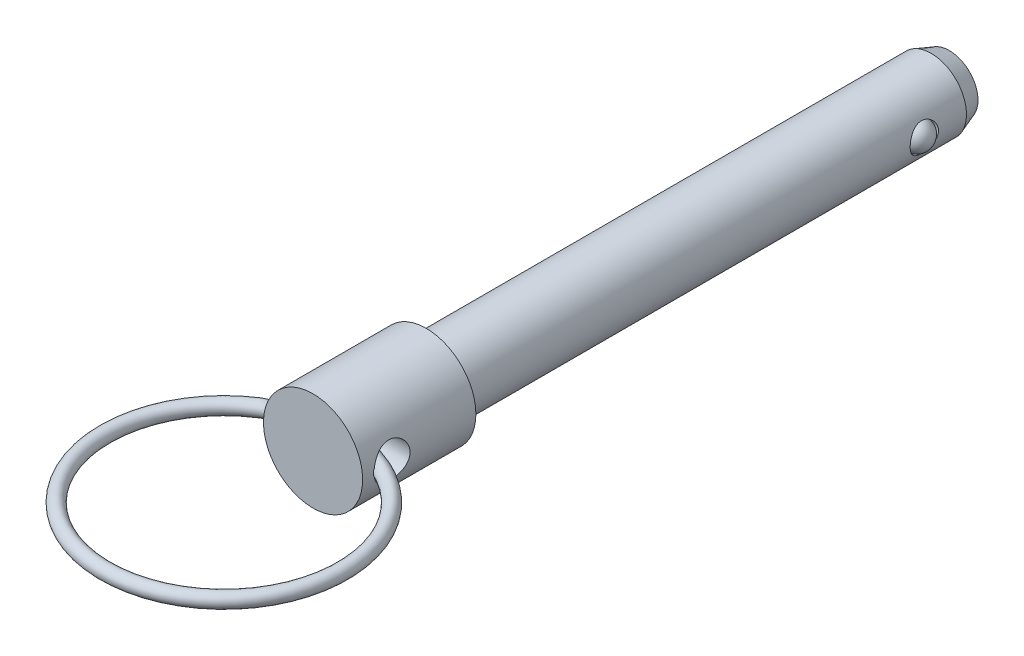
ISO-10303-21;
HEADER;
FILE_DESCRIPTION(('STEP AP214'),'2;1');
FILE_NAME('part.step','',(''),(''),'','','');
FILE_SCHEMA(('AUTOMOTIVE_DESIGN { 1 0 10303 214 1 1 1 1 }'));
ENDSEC;
DATA;
#1=APPLICATION_CONTEXT('core data for automotive mechanical design processes');
#2=APPLICATION_PROTOCOL_DEFINITION('international standard','automotive_design',2000,#1);
#3=PRODUCT_CONTEXT('',#1,'mechanical');
#4=PRODUCT('Part','Part','',(#3));
#5=PRODUCT_RELATED_PRODUCT_CATEGORY('part','',(#4));
#6=PRODUCT_DEFINITION_FORMATION('','',#4);
#7=PRODUCT_DEFINITION_CONTEXT('part definition',#1,'design');
#8=PRODUCT_DEFINITION('design','',#6,#7);
#9=PRODUCT_DEFINITION_SHAPE('','',#8);
#10=(LENGTH_UNIT() NAMED_UNIT(*) SI_UNIT(.MILLI.,.METRE.));
#11=(NAMED_UNIT(*) PLANE_ANGLE_UNIT() SI_UNIT($,.RADIAN.));
#12=(NAMED_UNIT(*) SI_UNIT($,.STERADIAN.) SOLID_ANGLE_UNIT());
#13=UNCERTAINTY_MEASURE_WITH_UNIT(LENGTH_MEASURE(1.E-05),#10,'distance_accuracy_value','');
#14=(GEOMETRIC_REPRESENTATION_CONTEXT(3) GLOBAL_UNCERTAINTY_ASSIGNED_CONTEXT((#13)) GLOBAL_UNIT_ASSIGNED_CONTEXT((#10,
#11,#12)) REPRESENTATION_CONTEXT('',''));
#15=CARTESIAN_POINT('',(0.,0.,0.));
#16=DIRECTION('',(0.,0.,1.));
#17=DIRECTION('',(1.,0.,0.));
#18=AXIS2_PLACEMENT_3D('',#15,#16,#17);
#19=CARTESIAN_POINT('',(7.9375,0.,9.398));
#20=DIRECTION('',(-1.,0.,0.));
#21=DIRECTION('',(0.,0.,-1.));
#22=AXIS2_PLACEMENT_3D('',#19,#20,#21);
#23=CYLINDRICAL_SURFACE('',#22,2.0193);
#24=CARTESIAN_POINT('',(-5.55645,0.413388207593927,11.3745329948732));
#25=CARTESIAN_POINT('',(-5.53323669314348,0.388835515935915,11.3796705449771));
#26=CARTESIAN_POINT('',(-5.51157389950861,0.362641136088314,11.3846690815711));
#27=CARTESIAN_POINT('',(-5.47216390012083,0.307044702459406,11.3940198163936));
#28=CARTESIAN_POINT('',(-5.4544497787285,0.277618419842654,11.3983664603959));
#29=CARTESIAN_POINT('',(-5.42406600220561,0.215851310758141,11.4059720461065));
#30=CARTESIAN_POINT('',(-5.41142802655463,0.183493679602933,11.4092241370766));
#31=CARTESIAN_POINT('',(-5.39235124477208,0.116986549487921,11.4141821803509));
#32=CARTESIAN_POINT('',(-5.38588919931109,0.0828442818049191,11.4158939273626));
#33=CARTESIAN_POINT('',(-5.37995615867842,0.0172985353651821,11.4174656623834));
#34=CARTESIAN_POINT('',(-5.37986165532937,-0.0140451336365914,11.4174908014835));
#35=CARTESIAN_POINT('',(-5.38511249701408,-0.076253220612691,11.4160995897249));
#36=CARTESIAN_POINT('',(-5.39046041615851,-0.107117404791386,11.4146825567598));
#37=CARTESIAN_POINT('',(-5.40574321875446,-0.165640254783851,11.4106965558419));
#38=CARTESIAN_POINT('',(-5.41539031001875,-0.19338072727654,11.408200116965));
#39=CARTESIAN_POINT('',(-5.43862859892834,-0.247073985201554,11.4023097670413));
#40=CARTESIAN_POINT('',(-5.45222392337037,-0.273024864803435,11.398914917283));
#41=CARTESIAN_POINT('',(-5.48024922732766,-0.318737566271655,11.3920973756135));
#42=CARTESIAN_POINT('',(-5.49418727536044,-0.33882099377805,11.3887682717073));
#43=CARTESIAN_POINT('',(-5.52397071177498,-0.377330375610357,11.3818282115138));
#44=CARTESIAN_POINT('',(-5.53980753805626,-0.395763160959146,11.378218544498));
#45=CARTESIAN_POINT('',(-5.55645,-0.413388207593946,11.3745329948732));
#46=B_SPLINE_CURVE_WITH_KNOTS('',3,(#24,#25,#26,#27,#28,#29,#30,#31,#32,#33,#34,#35,#36,#37,#38,
#39,#40,#41,#42,#43,#44,#45),.UNSPECIFIED.,.F.,.F.,(4,2,2,2,2,2,2,2,2,2,4),(0.,
0.102621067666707,0.206072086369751,0.31015905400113,0.413852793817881,0.507376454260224,
0.600944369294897,0.68901787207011,0.777183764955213,0.851068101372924,0.924630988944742),.UNSPECIFIED.);
#47=CARTESIAN_POINT('',(-5.54200209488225,0.397651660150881,11.3777589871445));
#48=VERTEX_POINT('',#47);
#49=CARTESIAN_POINT('',(-5.54200209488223,-0.397651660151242,11.3777589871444));
#50=VERTEX_POINT('',#49);
#51=EDGE_CURVE('E40',#48,#50,#46,.T.);
#52=ORIENTED_EDGE('',*,*,#51,.F.);
#53=CARTESIAN_POINT('',(-5.55625,0.,11.4173));
#54=CARTESIAN_POINT('',(-5.55624527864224,-0.109432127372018,11.4172937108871));
#55=CARTESIAN_POINT('',(-5.55298237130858,-0.218969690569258,11.408361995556));
#56=CARTESIAN_POINT('',(-5.54026368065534,-0.434902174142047,11.372953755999));
#57=CARTESIAN_POINT('',(-5.53079819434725,-0.54129189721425,11.3464497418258));
#58=CARTESIAN_POINT('',(-5.50670156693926,-0.74760504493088,11.2769560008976));
#59=CARTESIAN_POINT('',(-5.49208344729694,-0.847544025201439,11.2340078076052));
#60=CARTESIAN_POINT('',(-5.45915039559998,-1.03875753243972,11.1330083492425));
#61=CARTESIAN_POINT('',(-5.44083572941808,-1.13003268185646,11.0749581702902));
#62=CARTESIAN_POINT('',(-5.4015811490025,-1.30505728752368,10.9429422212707));
#63=CARTESIAN_POINT('',(-5.38056990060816,-1.38841141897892,10.8684736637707));
#64=CARTESIAN_POINT('',(-5.33865236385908,-1.54176439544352,10.7067995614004));
#65=CARTESIAN_POINT('',(-5.31774611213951,-1.61175885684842,10.6195898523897));
#66=CARTESIAN_POINT('',(-5.27759352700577,-1.73882919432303,10.4311528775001));
#67=CARTESIAN_POINT('',(-5.25843183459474,-1.79536185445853,10.3295394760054));
#68=CARTESIAN_POINT('',(-5.22503611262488,-1.89036141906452,10.1174402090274));
#69=CARTESIAN_POINT('',(-5.21080023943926,-1.92883508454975,10.0069576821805));
#70=CARTESIAN_POINT('',(-5.18962447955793,-1.98509166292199,9.78477737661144));
#71=CARTESIAN_POINT('',(-5.18242178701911,-2.00362275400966,9.67329490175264));
#72=CARTESIAN_POINT('',(-5.17535625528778,-2.02180769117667,9.44858805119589));
#73=CARTESIAN_POINT('',(-5.17549061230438,-2.02146874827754,9.33536435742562));
#74=CARTESIAN_POINT('',(-5.18285629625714,-2.00249790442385,9.11709454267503));
#75=CARTESIAN_POINT('',(-5.18969215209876,-1.98488533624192,9.01194405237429));
#76=CARTESIAN_POINT('',(-5.20903632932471,-1.93354575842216,8.80620743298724));
#77=CARTESIAN_POINT('',(-5.22154547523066,-1.89981640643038,8.70562196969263));
#78=CARTESIAN_POINT('',(-5.25107746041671,-1.81661001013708,8.50972358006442));
#79=CARTESIAN_POINT('',(-5.26817827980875,-1.76685762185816,8.41453987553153));
#80=CARTESIAN_POINT('',(-5.30493780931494,-1.65321144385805,8.23357336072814));
#81=CARTESIAN_POINT('',(-5.32459724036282,-1.58931366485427,8.14779321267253));
#82=CARTESIAN_POINT('',(-5.36576425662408,-1.44447059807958,7.98240722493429));
#83=CARTESIAN_POINT('',(-5.3873104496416,-1.36270785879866,7.90352531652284));
#84=CARTESIAN_POINT('',(-5.42876622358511,-1.18682967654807,7.76035905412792));
#85=CARTESIAN_POINT('',(-5.44867505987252,-1.09270866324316,7.69608131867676));
#86=CARTESIAN_POINT('',(-5.48497084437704,-0.893001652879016,7.58320896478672));
#87=CARTESIAN_POINT('',(-5.5013029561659,-0.787270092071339,7.53485348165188));
#88=CARTESIAN_POINT('',(-5.52817729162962,-0.56854036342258,7.4569293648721));
#89=CARTESIAN_POINT('',(-5.53873126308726,-0.45555746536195,7.42732259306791));
#90=CARTESIAN_POINT('',(-5.54924569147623,-0.284581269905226,7.39803699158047));
#91=CARTESIAN_POINT('',(-5.5518636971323,-0.227949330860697,7.3907957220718));
#92=CARTESIAN_POINT('',(-5.55536708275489,-0.114221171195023,7.3811255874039));
#93=CARTESIAN_POINT('',(-5.55625246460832,-0.05712495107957,7.37869671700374));
#94=CARTESIAN_POINT('',(-5.55624527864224,0.109432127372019,7.37870628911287));
#95=CARTESIAN_POINT('',(-5.55298237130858,0.218969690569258,7.38763800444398));
#96=CARTESIAN_POINT('',(-5.54026368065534,0.434902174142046,7.42304624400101));
#97=CARTESIAN_POINT('',(-5.53079819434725,0.54129189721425,7.44955025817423));
#98=CARTESIAN_POINT('',(-5.50670156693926,0.74760504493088,7.51904399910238));
#99=CARTESIAN_POINT('',(-5.49208344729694,0.847544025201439,7.56199219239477));
#100=CARTESIAN_POINT('',(-5.45915039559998,1.03875753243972,7.66299165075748));
#101=CARTESIAN_POINT('',(-5.44083572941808,1.13003268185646,7.72104182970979));
#102=CARTESIAN_POINT('',(-5.4015811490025,1.30505728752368,7.85305777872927));
#103=CARTESIAN_POINT('',(-5.38056990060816,1.38841141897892,7.92752633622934));
#104=CARTESIAN_POINT('',(-5.33865236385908,1.54176439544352,8.08920043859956));
#105=CARTESIAN_POINT('',(-5.31774611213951,1.61175885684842,8.17641014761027));
#106=CARTESIAN_POINT('',(-5.27759352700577,1.73882919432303,8.36484712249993));
#107=CARTESIAN_POINT('',(-5.25843183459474,1.79536185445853,8.46646052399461));
#108=CARTESIAN_POINT('',(-5.22503611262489,1.89036141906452,8.67855979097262));
#109=CARTESIAN_POINT('',(-5.21080023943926,1.92883508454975,8.78904231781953));
#110=CARTESIAN_POINT('',(-5.18962447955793,1.98509166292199,9.01122262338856));
#111=CARTESIAN_POINT('',(-5.18242178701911,2.00362275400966,9.12270509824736));
#112=CARTESIAN_POINT('',(-5.17535625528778,2.02180769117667,9.34741194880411));
#113=CARTESIAN_POINT('',(-5.17549061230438,2.02146874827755,9.46063564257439));
#114=CARTESIAN_POINT('',(-5.18285629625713,2.00249790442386,9.67890545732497));
#115=CARTESIAN_POINT('',(-5.18969215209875,1.98488533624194,9.78405594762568));
#116=CARTESIAN_POINT('',(-5.20903632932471,1.93354575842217,9.98979256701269));
#117=CARTESIAN_POINT('',(-5.22154547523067,1.89981640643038,10.0903780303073));
#118=CARTESIAN_POINT('',(-5.25107746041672,1.81661001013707,10.2862764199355));
#119=CARTESIAN_POINT('',(-5.26817827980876,1.76685762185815,10.3814601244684));
#120=CARTESIAN_POINT('',(-5.30493780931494,1.65321144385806,10.5624266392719));
#121=CARTESIAN_POINT('',(-5.32459724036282,1.58931366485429,10.6482067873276));
#122=CARTESIAN_POINT('',(-5.36576425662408,1.44447059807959,10.8135927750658));
#123=CARTESIAN_POINT('',(-5.38731044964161,1.36270785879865,10.8924746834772));
#124=CARTESIAN_POINT('',(-5.42876622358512,1.18682967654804,11.0356409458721));
#125=CARTESIAN_POINT('',(-5.44867505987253,1.09270866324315,11.0999186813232));
#126=CARTESIAN_POINT('',(-5.48497084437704,0.893001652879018,11.2127910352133));
#127=CARTESIAN_POINT('',(-5.5013029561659,0.787270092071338,11.2611465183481));
#128=CARTESIAN_POINT('',(-5.52817729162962,0.568540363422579,11.3390706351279));
#129=CARTESIAN_POINT('',(-5.53873126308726,0.455557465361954,11.3686774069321));
#130=CARTESIAN_POINT('',(-5.54924569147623,0.284581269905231,11.3979630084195));
#131=CARTESIAN_POINT('',(-5.5518636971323,0.227949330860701,11.4052042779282));
#132=CARTESIAN_POINT('',(-5.55536708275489,0.114221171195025,11.4148744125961));
#133=CARTESIAN_POINT('',(-5.55625246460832,0.0571249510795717,11.4173032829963));
#134=CARTESIAN_POINT('',(-5.55625,0.,11.4173));
#135=B_SPLINE_CURVE_WITH_KNOTS('',3,(#53,#54,#55,#56,#57,#58,#59,#60,#61,#62,#63,#64,#65,#66,
#67,#68,#69,#70,#71,#72,#73,#74,#75,#76,#77,#78,#79,#80,#81,#82,#83,#84,#85,#86,#87,#88,#89,#90,
#91,#92,#93,#94,#95,#96,#97,#98,#99,#100,#101,#102,#103,#104,#105,#106,#107,#108,#109,#110,#111,
#112,#113,#114,#115,#116,#117,#118,#119,#120,#121,#122,#123,#124,#125,#126,#127,#128,#129,#130,
#131,#132,#133,#134),.UNSPECIFIED.,.T.,.F.,(4,2,2,2,2,2,2,2,2,2,2,2,2,2,2,2,2,2,2,2,2,2,2,2,2,2,
2,2,2,2,2,2,2,2,2,2,2,2,2,2,4),(0.,0.328075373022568,0.656665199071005,0.984430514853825,
1.31217226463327,1.65185430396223,1.99164760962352,2.34343505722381,2.69509069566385,
3.03303658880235,3.3708533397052,3.68986542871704,4.00892389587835,4.33378721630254,
4.65874227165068,5.00406386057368,5.34954163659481,5.69999369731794,6.04973056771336,
6.22099023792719,6.39224972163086,6.72032509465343,7.04891492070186,7.37668023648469,
7.70442198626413,8.04410402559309,8.38389733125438,8.73568477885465,9.0873404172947,
9.42528631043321,9.76310306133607,10.0821151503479,10.4011736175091,10.7260369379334,
11.0509919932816,11.3963135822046,11.7417913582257,12.0922434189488,12.4419802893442,
12.6132399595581,12.7844994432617),.UNSPECIFIED.);
#136=EDGE_CURVE('E66',#50,#48,#135,.T.);
#137=ORIENTED_EDGE('',*,*,#136,.F.);
#138=EDGE_LOOP('',(#52,#137));
#139=FACE_BOUND('',#138,.T.);
#140=CARTESIAN_POINT('',(5.55645,-0.413388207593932,11.3745329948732));
#141=CARTESIAN_POINT('',(5.53323669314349,-0.388835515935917,11.3796705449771));
#142=CARTESIAN_POINT('',(5.51157389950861,-0.362641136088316,11.3846690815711));
#143=CARTESIAN_POINT('',(5.47216390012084,-0.307044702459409,11.3940198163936));
#144=CARTESIAN_POINT('',(5.45444977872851,-0.277618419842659,11.3983664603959));
#145=CARTESIAN_POINT('',(5.42406600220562,-0.215851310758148,11.4059720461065));
#146=CARTESIAN_POINT('',(5.41142802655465,-0.183493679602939,11.4092241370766));
#147=CARTESIAN_POINT('',(5.39235124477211,-0.116986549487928,11.4141821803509));
#148=CARTESIAN_POINT('',(5.38588919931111,-0.0828442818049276,11.4158939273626));
#149=CARTESIAN_POINT('',(5.37995615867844,-0.0172985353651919,11.4174656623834));
#150=CARTESIAN_POINT('',(5.37986165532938,0.0140451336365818,11.4174908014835));
#151=CARTESIAN_POINT('',(5.3851124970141,0.0762532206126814,11.4160995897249));
#152=CARTESIAN_POINT('',(5.39046041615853,0.107117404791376,11.4146825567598));
#153=CARTESIAN_POINT('',(5.40574321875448,0.16564025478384,11.4106965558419));
#154=CARTESIAN_POINT('',(5.41539031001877,0.193380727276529,11.408200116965));
#155=CARTESIAN_POINT('',(5.43862859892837,0.247073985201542,11.4023097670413));
#156=CARTESIAN_POINT('',(5.4522239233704,0.273024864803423,11.398914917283));
#157=CARTESIAN_POINT('',(5.48024922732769,0.318737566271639,11.3920973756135));
#158=CARTESIAN_POINT('',(5.49418727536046,0.338820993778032,11.3887682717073));
#159=CARTESIAN_POINT('',(5.52397071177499,0.377330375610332,11.3818282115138));
#160=CARTESIAN_POINT('',(5.53980753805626,0.395763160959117,11.378218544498));
#161=CARTESIAN_POINT('',(5.55645,0.413388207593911,11.3745329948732));
#162=B_SPLINE_CURVE_WITH_KNOTS('',3,(#140,#141,#142,#143,#144,#145,#146,#147,#148,#149,#150,
#151,#152,#153,#154,#155,#156,#157,#158,#159,#160,#161),.UNSPECIFIED.,.F.,.F.,(4,2,2,2,2,2,2,2,
2,2,4),(0.,0.102621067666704,0.206072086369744,0.310159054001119,0.413852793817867,
0.50737645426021,0.600944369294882,0.689017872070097,0.777183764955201,0.851068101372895,
0.924630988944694),.UNSPECIFIED.);
#163=CARTESIAN_POINT('',(5.54200209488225,-0.397651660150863,11.3777589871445));
#164=VERTEX_POINT('',#163);
#165=CARTESIAN_POINT('',(5.54200209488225,0.397651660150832,11.3777589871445));
#166=VERTEX_POINT('',#165);
#167=EDGE_CURVE('E33',#164,#166,#162,.T.);
#168=ORIENTED_EDGE('',*,*,#167,.F.);
#169=CARTESIAN_POINT('',(5.55625,0.,7.3787));
#170=CARTESIAN_POINT('',(5.55624527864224,-0.109432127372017,7.37870628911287));
#171=CARTESIAN_POINT('',(5.55298237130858,-0.218969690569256,7.38763800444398));
#172=CARTESIAN_POINT('',(5.54026368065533,-0.434902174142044,7.42304624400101));
#173=CARTESIAN_POINT('',(5.53079819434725,-0.541291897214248,7.44955025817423));
#174=CARTESIAN_POINT('',(5.50670156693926,-0.747605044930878,7.51904399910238));
#175=CARTESIAN_POINT('',(5.49208344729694,-0.847544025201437,7.56199219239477));
#176=CARTESIAN_POINT('',(5.45915039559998,-1.03875753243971,7.66299165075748));
#177=CARTESIAN_POINT('',(5.44083572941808,-1.13003268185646,7.72104182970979));
#178=CARTESIAN_POINT('',(5.4015811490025,-1.30505728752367,7.85305777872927));
#179=CARTESIAN_POINT('',(5.38056990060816,-1.38841141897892,7.92752633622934));
#180=CARTESIAN_POINT('',(5.33865236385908,-1.54176439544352,8.08920043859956));
#181=CARTESIAN_POINT('',(5.31774611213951,-1.61175885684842,8.17641014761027));
#182=CARTESIAN_POINT('',(5.27759352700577,-1.73882919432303,8.36484712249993));
#183=CARTESIAN_POINT('',(5.25843183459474,-1.79536185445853,8.46646052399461));
#184=CARTESIAN_POINT('',(5.22503611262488,-1.89036141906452,8.67855979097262));
#185=CARTESIAN_POINT('',(5.21080023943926,-1.92883508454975,8.78904231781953));
#186=CARTESIAN_POINT('',(5.18962447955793,-1.98509166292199,9.01122262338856));
#187=CARTESIAN_POINT('',(5.18242178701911,-2.00362275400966,9.12270509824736));
#188=CARTESIAN_POINT('',(5.17535625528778,-2.02180769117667,9.34741194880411));
#189=CARTESIAN_POINT('',(5.17549061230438,-2.02146874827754,9.46063564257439));
#190=CARTESIAN_POINT('',(5.18285629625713,-2.00249790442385,9.67890545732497));
#191=CARTESIAN_POINT('',(5.18969215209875,-1.98488533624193,9.78405594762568));
#192=CARTESIAN_POINT('',(5.2090363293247,-1.93354575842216,9.98979256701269));
#193=CARTESIAN_POINT('',(5.22154547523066,-1.89981640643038,10.0903780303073));
#194=CARTESIAN_POINT('',(5.25107746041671,-1.81661001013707,10.2862764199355));
#195=CARTESIAN_POINT('',(5.26817827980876,-1.76685762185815,10.3814601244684));
#196=CARTESIAN_POINT('',(5.30493780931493,-1.65321144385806,10.5624266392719));
#197=CARTESIAN_POINT('',(5.32459724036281,-1.58931366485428,10.6482067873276));
#198=CARTESIAN_POINT('',(5.36576425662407,-1.44447059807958,10.8135927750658));
#199=CARTESIAN_POINT('',(5.3873104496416,-1.36270785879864,10.8924746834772));
#200=CARTESIAN_POINT('',(5.42876622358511,-1.18682967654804,11.0356409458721));
#201=CARTESIAN_POINT('',(5.44867505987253,-1.09270866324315,11.0999186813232));
#202=CARTESIAN_POINT('',(5.48497084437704,-0.893001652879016,11.2127910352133));
#203=CARTESIAN_POINT('',(5.50130295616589,-0.787270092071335,11.2611465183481));
#204=CARTESIAN_POINT('',(5.52817729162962,-0.568540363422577,11.3390706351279));
#205=CARTESIAN_POINT('',(5.53873126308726,-0.455557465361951,11.3686774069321));
#206=CARTESIAN_POINT('',(5.54924569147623,-0.284581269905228,11.3979630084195));
#207=CARTESIAN_POINT('',(5.5518636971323,-0.227949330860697,11.4052042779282));
#208=CARTESIAN_POINT('',(5.55536708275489,-0.114221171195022,11.4148744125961));
#209=CARTESIAN_POINT('',(5.55625246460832,-0.0571249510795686,11.4173032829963));
#210=CARTESIAN_POINT('',(5.55624527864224,0.109432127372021,11.4172937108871));
#211=CARTESIAN_POINT('',(5.55298237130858,0.218969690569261,11.408361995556));
#212=CARTESIAN_POINT('',(5.54026368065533,0.434902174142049,11.372953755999));
#213=CARTESIAN_POINT('',(5.53079819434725,0.541291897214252,11.3464497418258));
#214=CARTESIAN_POINT('',(5.50670156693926,0.747605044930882,11.2769560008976));
#215=CARTESIAN_POINT('',(5.49208344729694,0.847544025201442,11.2340078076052));
#216=CARTESIAN_POINT('',(5.45915039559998,1.03875753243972,11.1330083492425));
#217=CARTESIAN_POINT('',(5.44083572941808,1.13003268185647,11.0749581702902));
#218=CARTESIAN_POINT('',(5.4015811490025,1.30505728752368,10.9429422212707));
#219=CARTESIAN_POINT('',(5.38056990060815,1.38841141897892,10.8684736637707));
#220=CARTESIAN_POINT('',(5.33865236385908,1.54176439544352,10.7067995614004));
#221=CARTESIAN_POINT('',(5.31774611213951,1.61175885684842,10.6195898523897));
#222=CARTESIAN_POINT('',(5.27759352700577,1.73882919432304,10.4311528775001));
#223=CARTESIAN_POINT('',(5.25843183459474,1.79536185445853,10.3295394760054));
#224=CARTESIAN_POINT('',(5.22503611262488,1.89036141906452,10.1174402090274));
#225=CARTESIAN_POINT('',(5.21080023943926,1.92883508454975,10.0069576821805));
#226=CARTESIAN_POINT('',(5.18962447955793,1.98509166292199,9.78477737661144));
#227=CARTESIAN_POINT('',(5.18242178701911,2.00362275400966,9.67329490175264));
#228=CARTESIAN_POINT('',(5.17535625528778,2.02180769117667,9.44858805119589));
#229=CARTESIAN_POINT('',(5.17549061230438,2.02146874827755,9.33536435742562));
#230=CARTESIAN_POINT('',(5.18285629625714,2.00249790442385,9.11709454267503));
#231=CARTESIAN_POINT('',(5.18969215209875,1.98488533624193,9.01194405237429));
#232=CARTESIAN_POINT('',(5.2090363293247,1.93354575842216,8.80620743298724));
#233=CARTESIAN_POINT('',(5.22154547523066,1.89981640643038,8.70562196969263));
#234=CARTESIAN_POINT('',(5.25107746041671,1.81661001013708,8.50972358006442));
#235=CARTESIAN_POINT('',(5.26817827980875,1.76685762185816,8.41453987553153));
#236=CARTESIAN_POINT('',(5.30493780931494,1.65321144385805,8.23357336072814));
#237=CARTESIAN_POINT('',(5.32459724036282,1.58931366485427,8.14779321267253));
#238=CARTESIAN_POINT('',(5.36576425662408,1.44447059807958,7.98240722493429));
#239=CARTESIAN_POINT('',(5.3873104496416,1.36270785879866,7.90352531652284));
#240=CARTESIAN_POINT('',(5.42876622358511,1.18682967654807,7.76035905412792));
#241=CARTESIAN_POINT('',(5.44867505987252,1.09270866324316,7.69608131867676));
#242=CARTESIAN_POINT('',(5.48497084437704,0.893001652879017,7.58320896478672));
#243=CARTESIAN_POINT('',(5.50130295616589,0.78727009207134,7.53485348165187));
#244=CARTESIAN_POINT('',(5.52817729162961,0.568540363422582,7.4569293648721));
#245=CARTESIAN_POINT('',(5.53873126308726,0.455557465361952,7.42732259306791));
#246=CARTESIAN_POINT('',(5.54924569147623,0.284581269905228,7.39803699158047));
#247=CARTESIAN_POINT('',(5.5518636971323,0.227949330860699,7.3907957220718));
#248=CARTESIAN_POINT('',(5.55536708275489,0.114221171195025,7.3811255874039));
#249=CARTESIAN_POINT('',(5.55625246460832,0.0571249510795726,7.37869671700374));
#250=CARTESIAN_POINT('',(5.55625,0.,7.3787));
#251=B_SPLINE_CURVE_WITH_KNOTS('',3,(#169,#170,#171,#172,#173,#174,#175,#176,#177,#178,#179,
#180,#181,#182,#183,#184,#185,#186,#187,#188,#189,#190,#191,#192,#193,#194,#195,#196,#197,#198,
#199,#200,#201,#202,#203,#204,#205,#206,#207,#208,#209,#210,#211,#212,#213,#214,#215,#216,#217,
#218,#219,#220,#221,#222,#223,#224,#225,#226,#227,#228,#229,#230,#231,#232,#233,#234,#235,#236,
#237,#238,#239,#240,#241,#242,#243,#244,#245,#246,#247,#248,#249,#250),.UNSPECIFIED.,.T.,.F.,(4,
2,2,2,2,2,2,2,2,2,2,2,2,2,2,2,2,2,2,2,2,2,2,2,2,2,2,2,2,2,2,2,2,2,2,2,2,2,2,2,4),(0.,
0.328075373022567,0.656665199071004,0.984430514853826,1.31217226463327,1.65185430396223,
1.99164760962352,2.34343505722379,2.69509069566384,3.03303658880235,3.37085333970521,
3.68986542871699,4.00892389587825,4.33378721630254,4.65874227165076,5.00406386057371,
5.34954163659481,5.69999369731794,6.04973056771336,6.22099023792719,6.39224972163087,
6.72032509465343,7.04891492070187,7.37668023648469,7.70442198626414,8.04410402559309,
8.38389733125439,8.73568477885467,9.08734041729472,9.42528631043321,9.76310306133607,
10.0821151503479,10.4011736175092,10.7260369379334,11.0509919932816,11.3963135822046,
11.7417913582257,12.0922434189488,12.4419802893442,12.6132399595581,12.7844994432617),.UNSPECIFIED.);
#252=EDGE_CURVE('E62',#166,#164,#251,.T.);
#253=ORIENTED_EDGE('',*,*,#252,.F.);
#254=EDGE_LOOP('',(#168,#253));
#255=FACE_BOUND('',#254,.T.);
#256=ADVANCED_FACE('F14',(#139,#255),#23,.F.);
#257=CARTESIAN_POINT('',(0.,0.,-28.63596));
#258=DIRECTION('',(0.,0.,-1.));
#259=DIRECTION('',(1.,0.,0.));
#260=AXIS2_PLACEMENT_3D('',#257,#258,#259);
#261=CYLINDRICAL_SURFACE('',#260,5.55625);
#262=ORIENTED_EDGE('',*,*,#252,.T.);
#263=CARTESIAN_POINT('',(5.55009347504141,-0.261488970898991,9.7860840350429));
#264=CARTESIAN_POINT('',(5.54812529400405,-0.30325141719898,9.80096224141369));
#265=CARTESIAN_POINT('',(5.5457404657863,-0.343758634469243,9.81942005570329));
#266=CARTESIAN_POINT('',(5.54040847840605,-0.42106674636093,9.86292845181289));
#267=CARTESIAN_POINT('',(5.5374605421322,-0.457862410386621,9.88798816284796));
#268=CARTESIAN_POINT('',(5.53134134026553,-0.526658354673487,9.94386457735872));
#269=CARTESIAN_POINT('',(5.52817046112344,-0.558666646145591,9.97467146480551));
#270=CARTESIAN_POINT('',(5.52194469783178,-0.617178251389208,10.0411137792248));
#271=CARTESIAN_POINT('',(5.51888978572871,-0.64368289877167,10.0767480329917));
#272=CARTESIAN_POINT('',(5.51313628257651,-0.691254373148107,10.1527268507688));
#273=CARTESIAN_POINT('',(5.51044827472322,-0.712171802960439,10.1931655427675));
#274=CARTESIAN_POINT('',(5.50578097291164,-0.747399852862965,10.2768577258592));
#275=CARTESIAN_POINT('',(5.50380188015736,-0.761708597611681,10.3201120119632));
#276=CARTESIAN_POINT('',(5.50062483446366,-0.784334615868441,10.4110491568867));
#277=CARTESIAN_POINT('',(5.4994831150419,-0.792223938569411,10.4588401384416));
#278=CARTESIAN_POINT('',(5.49826873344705,-0.800607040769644,10.5550754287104));
#279=CARTESIAN_POINT('',(5.49819646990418,-0.801098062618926,10.6035199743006));
#280=CARTESIAN_POINT('',(5.49912806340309,-0.794680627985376,10.7039443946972));
#281=CARTESIAN_POINT('',(5.50022168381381,-0.787154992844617,10.7558841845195));
#282=CARTESIAN_POINT('',(5.50347103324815,-0.764103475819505,10.8579332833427));
#283=CARTESIAN_POINT('',(5.5056272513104,-0.748573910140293,10.9080417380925));
#284=CARTESIAN_POINT('',(5.51091051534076,-0.708667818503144,11.0082212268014));
#285=CARTESIAN_POINT('',(5.51408971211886,-0.683800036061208,11.0580951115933));
#286=CARTESIAN_POINT('',(5.52096808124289,-0.62583951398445,11.1528267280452));
#287=CARTESIAN_POINT('',(5.52466742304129,-0.592744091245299,11.1976828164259));
#288=CARTESIAN_POINT('',(5.53199718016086,-0.519831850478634,11.2794067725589));
#289=CARTESIAN_POINT('',(5.53562669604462,-0.480224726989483,11.3164602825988));
#290=CARTESIAN_POINT('',(5.54239660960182,-0.39445002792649,11.3820559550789));
#291=CARTESIAN_POINT('',(5.54553772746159,-0.348292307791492,11.4106107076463));
#292=CARTESIAN_POINT('',(5.55042537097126,-0.257766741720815,11.4537693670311));
#293=CARTESIAN_POINT('',(5.55230678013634,-0.214079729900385,11.4697807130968));
#294=CARTESIAN_POINT('',(5.55503790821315,-0.124373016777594,11.4927832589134));
#295=CARTESIAN_POINT('',(5.55588906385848,-0.0783566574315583,11.4997870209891));
#296=CARTESIAN_POINT('',(5.55638432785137,0.0070585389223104,11.5038718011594));
#297=CARTESIAN_POINT('',(5.55619261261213,0.0463971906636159,11.5023023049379));
#298=CARTESIAN_POINT('',(5.55499790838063,0.124194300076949,11.4923961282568));
#299=CARTESIAN_POINT('',(5.55399500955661,0.162652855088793,11.484060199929));
#300=CARTESIAN_POINT('',(5.55133569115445,0.236455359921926,11.4614747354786));
#301=CARTESIAN_POINT('',(5.54970019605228,0.271858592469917,11.4474138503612));
#302=CARTESIAN_POINT('',(5.54593788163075,0.340082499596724,11.414086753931));
#303=CARTESIAN_POINT('',(5.54381093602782,0.372902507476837,11.394819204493));
#304=CARTESIAN_POINT('',(5.53902830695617,0.438479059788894,11.3497412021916));
#305=CARTESIAN_POINT('',(5.53634134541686,0.470920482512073,11.3234773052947));
#306=CARTESIAN_POINT('',(5.5308403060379,0.531649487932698,11.2665410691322));
#307=CARTESIAN_POINT('',(5.52802616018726,0.559934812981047,11.2358663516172));
#308=CARTESIAN_POINT('',(5.52207389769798,0.616058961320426,11.1660010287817));
#309=CARTESIAN_POINT('',(5.51895184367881,0.64317151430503,11.1262251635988));
#310=CARTESIAN_POINT('',(5.5131400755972,0.69122128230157,11.0430715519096));
#311=CARTESIAN_POINT('',(5.51045062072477,0.712154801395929,10.9996916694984));
#312=CARTESIAN_POINT('',(5.50546631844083,0.749774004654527,10.9047684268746));
#313=CARTESIAN_POINT('',(5.5032620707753,0.765608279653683,10.8528805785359));
#314=CARTESIAN_POINT('',(5.49999925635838,0.788707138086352,10.7471802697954));
#315=CARTESIAN_POINT('',(5.49894104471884,0.795969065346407,10.693367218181));
#316=CARTESIAN_POINT('',(5.49812737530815,0.801573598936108,10.5836973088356));
#317=CARTESIAN_POINT('',(5.49841008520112,0.799654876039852,10.5278260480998));
#318=CARTESIAN_POINT('',(5.50039129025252,0.785912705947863,10.4173293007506));
#319=CARTESIAN_POINT('',(5.50208922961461,0.774093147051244,10.3627033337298));
#320=CARTESIAN_POINT('',(5.50657222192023,0.74150273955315,10.2600057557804));
#321=CARTESIAN_POINT('',(5.50928213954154,0.721341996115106,10.2117380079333));
#322=CARTESIAN_POINT('',(5.51545799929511,0.672487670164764,10.1197820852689));
#323=CARTESIAN_POINT('',(5.51892350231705,0.643799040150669,10.0760912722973));
#324=CARTESIAN_POINT('',(5.52582601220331,0.581424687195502,9.99852087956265));
#325=CARTESIAN_POINT('',(5.52923968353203,0.548383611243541,9.96412004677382));
#326=CARTESIAN_POINT('',(5.53588272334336,0.476663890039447,9.90178589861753));
#327=CARTESIAN_POINT('',(5.53911216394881,0.437987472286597,9.87385003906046));
#328=CARTESIAN_POINT('',(5.54480401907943,0.358545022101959,9.82683552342));
#329=CARTESIAN_POINT('',(5.54729992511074,0.318028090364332,9.80733901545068));
#330=CARTESIAN_POINT('',(5.55147034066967,0.23419907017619,9.7755782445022));
#331=CARTESIAN_POINT('',(5.55314476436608,0.190886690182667,9.76331473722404));
#332=CARTESIAN_POINT('',(5.55544526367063,0.103875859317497,9.74662090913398));
#333=CARTESIAN_POINT('',(5.55609634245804,0.0602137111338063,9.7420036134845));
#334=CARTESIAN_POINT('',(5.55635470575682,-0.0272293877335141,9.74015977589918));
#335=CARTESIAN_POINT('',(5.55596342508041,-0.0710100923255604,9.74292307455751));
#336=CARTESIAN_POINT('',(5.55456091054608,-0.139289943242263,9.75303365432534));
#337=CARTESIAN_POINT('',(5.55387840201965,-0.164176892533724,9.75797314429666));
#338=CARTESIAN_POINT('',(5.55220711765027,-0.213342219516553,9.77024669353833));
#339=CARTESIAN_POINT('',(5.55121834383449,-0.237620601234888,9.77758073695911));
#340=CARTESIAN_POINT('',(5.55009347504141,-0.261488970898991,9.7860840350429));
#341=B_SPLINE_CURVE_WITH_KNOTS('',3,(#263,#264,#265,#266,#267,#268,#269,#270,#271,#272,#273,
#274,#275,#276,#277,#278,#279,#280,#281,#282,#283,#284,#285,#286,#287,#288,#289,#290,#291,#292,
#293,#294,#295,#296,#297,#298,#299,#300,#301,#302,#303,#304,#305,#306,#307,#308,#309,#310,#311,
#312,#313,#314,#315,#316,#317,#318,#319,#320,#321,#322,#323,#324,#325,#326,#327,#328,#329,#330,
#331,#332,#333,#334,#335,#336,#337,#338,#339,#340),.UNSPECIFIED.,.T.,.F.,(4,2,2,2,2,2,2,2,2,2,2,
2,2,2,2,2,2,2,2,2,2,2,2,2,2,2,2,2,2,2,2,2,2,2,2,2,2,2,4),(0.,0.133035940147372,
0.266256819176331,0.399252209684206,0.532215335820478,0.66844121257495,0.804705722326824,
0.949444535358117,1.09423729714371,1.25104087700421,1.40791668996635,1.57457416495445,
1.7412860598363,1.90341673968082,2.06530602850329,2.20414603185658,2.34279219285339,
2.46030997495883,2.57781469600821,2.69172579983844,2.80566620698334,2.93066170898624,
3.05572486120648,3.19986521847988,3.34409161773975,3.50624490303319,3.66844841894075,
3.83529611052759,4.00207830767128,4.15836501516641,4.31456113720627,4.45728171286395,
4.59994602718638,4.73438372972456,4.86883547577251,4.99994808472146,5.13088030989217,
5.20691445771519,5.28294810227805),.UNSPECIFIED.);
#342=EDGE_CURVE('E27',#164,#166,#341,.T.);
#343=ORIENTED_EDGE('',*,*,#342,.T.);
#344=EDGE_LOOP('',(#262,#343));
#345=FACE_BOUND('',#344,.T.);
#346=CARTESIAN_POINT('',(0.,0.,-8.27046764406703E-11));
#347=DIRECTION('',(0.,0.,-1.));
#348=DIRECTION('',(1.,0.,0.));
#349=AXIS2_PLACEMENT_3D('',#346,#347,#348);
#350=CIRCLE('',#349,5.55625000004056);
#351=CARTESIAN_POINT('',(5.55625000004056,0.,-8.2704921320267E-11));
#352=VERTEX_POINT('',#351);
#353=EDGE_CURVE('E71',#352,#352,#350,.T.);
#354=ORIENTED_EDGE('',*,*,#353,.F.);
#355=EDGE_LOOP('',(#354));
#356=FACE_BOUND('',#355,.T.);
#357=CARTESIAN_POINT('',(0.,0.,12.7000000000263));
#358=DIRECTION('',(0.,0.,-1.));
#359=DIRECTION('',(1.,0.,0.));
#360=AXIS2_PLACEMENT_3D('',#357,#358,#359);
#361=CIRCLE('',#360,5.55625000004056);
#362=CARTESIAN_POINT('',(5.55625000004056,0.,12.7000000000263));
#363=VERTEX_POINT('',#362);
#364=EDGE_CURVE('E279',#363,#363,#361,.T.);
#365=ORIENTED_EDGE('',*,*,#364,.T.);
#366=EDGE_LOOP('',(#365));
#367=FACE_BOUND('',#366,.T.);
#368=ORIENTED_EDGE('',*,*,#136,.T.);
#369=CARTESIAN_POINT('',(-5.55009347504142,-0.261488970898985,9.786084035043));
#370=CARTESIAN_POINT('',(-5.55201952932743,-0.220600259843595,9.77152029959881));
#371=CARTESIAN_POINT('',(-5.55354800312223,-0.178464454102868,9.76037150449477));
#372=CARTESIAN_POINT('',(-5.5556384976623,-0.0928868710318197,9.74524129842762));
#373=CARTESIAN_POINT('',(-5.55620009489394,-0.0494445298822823,9.74126302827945));
#374=CARTESIAN_POINT('',(-5.55629347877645,0.0374935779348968,9.74059719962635));
#375=CARTESIAN_POINT('',(-5.55582538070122,0.0809893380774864,9.74390882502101));
#376=CARTESIAN_POINT('',(-5.55391173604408,0.16679574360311,9.75772411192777));
#377=CARTESIAN_POINT('',(-5.5524662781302,0.209106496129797,9.76822712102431));
#378=CARTESIAN_POINT('',(-5.54875885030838,0.291350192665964,9.79611251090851));
#379=CARTESIAN_POINT('',(-5.54649699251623,0.331283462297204,9.81349394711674));
#380=CARTESIAN_POINT('',(-5.54140563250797,0.407683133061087,9.85461863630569));
#381=CARTESIAN_POINT('',(-5.53857612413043,0.444149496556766,9.87836195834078));
#382=CARTESIAN_POINT('',(-5.53262152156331,0.51305431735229,9.93180289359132));
#383=CARTESIAN_POINT('',(-5.52949345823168,0.545442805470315,9.96156453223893));
#384=CARTESIAN_POINT('',(-5.52330278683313,0.604927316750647,10.0259730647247));
#385=CARTESIAN_POINT('',(-5.52024018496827,0.632022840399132,10.0606204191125));
#386=CARTESIAN_POINT('',(-5.51440051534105,0.681126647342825,10.1349305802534));
#387=CARTESIAN_POINT('',(-5.51163525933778,0.702950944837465,10.1747156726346));
#388=CARTESIAN_POINT('',(-5.50677513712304,0.740062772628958,10.2572565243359));
#389=CARTESIAN_POINT('',(-5.50468043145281,0.755348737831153,10.3000129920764));
#390=CARTESIAN_POINT('',(-5.50124315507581,0.780002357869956,10.3899815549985));
#391=CARTESIAN_POINT('',(-5.49995301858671,0.788961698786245,10.4373072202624));
#392=CARTESIAN_POINT('',(-5.498425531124,0.799536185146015,10.5327838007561));
#393=CARTESIAN_POINT('',(-5.49818856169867,0.801148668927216,10.580935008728));
#394=CARTESIAN_POINT('',(-5.49877665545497,0.797104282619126,10.6808979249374));
#395=CARTESIAN_POINT('',(-5.49969077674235,0.790837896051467,10.7326845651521));
#396=CARTESIAN_POINT('',(-5.502598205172,0.770345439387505,10.8346351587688));
#397=CARTESIAN_POINT('',(-5.50459199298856,0.756115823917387,10.8847983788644));
#398=CARTESIAN_POINT('',(-5.50958513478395,0.718862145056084,10.9855133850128));
#399=CARTESIAN_POINT('',(-5.51264228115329,0.695318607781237,11.0358713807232));
#400=CARTESIAN_POINT('',(-5.51933971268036,0.639982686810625,11.1318512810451));
#401=CARTESIAN_POINT('',(-5.5229802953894,0.608186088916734,11.177470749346));
#402=CARTESIAN_POINT('',(-5.53030695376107,0.537456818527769,11.2614236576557));
#403=CARTESIAN_POINT('',(-5.53399100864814,0.498663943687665,11.2998741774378));
#404=CARTESIAN_POINT('',(-5.54094301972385,0.414294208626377,11.3684444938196));
#405=CARTESIAN_POINT('',(-5.54421186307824,0.368732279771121,11.3985822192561));
#406=CARTESIAN_POINT('',(-5.54902610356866,0.28540930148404,11.4415518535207));
#407=CARTESIAN_POINT('',(-5.55079831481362,0.248931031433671,11.4568629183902));
#408=CARTESIAN_POINT('',(-5.55365405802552,0.173909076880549,11.4812007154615));
#409=CARTESIAN_POINT('',(-5.55473812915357,0.135367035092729,11.4902323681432));
#410=CARTESIAN_POINT('',(-5.55609389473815,0.0571634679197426,11.5014913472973));
#411=CARTESIAN_POINT('',(-5.55636320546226,0.0174989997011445,11.5036987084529));
#412=CARTESIAN_POINT('',(-5.55604928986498,-0.0615987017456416,11.5011080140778));
#413=CARTESIAN_POINT('',(-5.55546601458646,-0.101031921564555,11.4963095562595));
#414=CARTESIAN_POINT('',(-5.5535635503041,-0.176675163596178,11.4803936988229));
#415=CARTESIAN_POINT('',(-5.55227928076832,-0.212950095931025,11.4695756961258));
#416=CARTESIAN_POINT('',(-5.54913333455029,-0.283330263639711,11.4424161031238));
#417=CARTESIAN_POINT('',(-5.54727154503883,-0.317435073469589,11.4260734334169));
#418=CARTESIAN_POINT('',(-5.54300097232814,-0.385072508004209,11.3872975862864));
#419=CARTESIAN_POINT('',(-5.54056357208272,-0.418407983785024,11.3645254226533));
#420=CARTESIAN_POINT('',(-5.53544762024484,-0.481387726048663,11.3143838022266));
#421=CARTESIAN_POINT('',(-5.53276895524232,-0.511030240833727,11.2870121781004));
#422=CARTESIAN_POINT('',(-5.52699292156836,-0.570330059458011,11.2242365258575));
#423=CARTESIAN_POINT('',(-5.52389129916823,-0.599362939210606,11.1882432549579));
#424=CARTESIAN_POINT('',(-5.51794192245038,-0.651866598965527,11.1123875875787));
#425=CARTESIAN_POINT('',(-5.51509432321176,-0.675333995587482,11.0725228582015));
#426=CARTESIAN_POINT('',(-5.50953849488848,-0.719347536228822,10.9840543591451));
#427=CARTESIAN_POINT('',(-5.50690598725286,-0.739020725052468,10.9350095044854));
#428=CARTESIAN_POINT('',(-5.50259788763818,-0.770442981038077,10.8343900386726));
#429=CARTESIAN_POINT('',(-5.50092272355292,-0.782188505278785,10.782814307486));
#430=CARTESIAN_POINT('',(-5.49868146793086,-0.797800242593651,10.6753545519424));
#431=CARTESIAN_POINT('',(-5.49818587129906,-0.801166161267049,10.6193948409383));
#432=CARTESIAN_POINT('',(-5.49862892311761,-0.798121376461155,10.5077343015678));
#433=CARTESIAN_POINT('',(-5.49956724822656,-0.791712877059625,10.452033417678));
#434=CARTESIAN_POINT('',(-5.50274081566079,-0.769336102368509,10.3451160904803));
#435=CARTESIAN_POINT('',(-5.50491833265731,-0.75379238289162,10.2938098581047));
#436=CARTESIAN_POINT('',(-5.51027934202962,-0.713544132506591,10.1949693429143));
#437=CARTESIAN_POINT('',(-5.51346234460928,-0.688844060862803,10.1474332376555));
#438=CARTESIAN_POINT('',(-5.52010275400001,-0.633315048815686,10.0619154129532));
#439=CARTESIAN_POINT('',(-5.52351228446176,-0.60320515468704,10.0234624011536));
#440=CARTESIAN_POINT('',(-5.53038590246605,-0.536527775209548,9.95266893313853));
#441=CARTESIAN_POINT('',(-5.53384993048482,-0.499966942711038,9.92032224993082));
#442=CARTESIAN_POINT('',(-5.53964550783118,-0.430319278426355,9.86936528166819));
#443=CARTESIAN_POINT('',(-5.54205683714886,-0.398291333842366,9.84930122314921));
#444=CARTESIAN_POINT('',(-5.54644342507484,-0.331652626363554,9.813992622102));
#445=CARTESIAN_POINT('',(-5.54841874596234,-0.297042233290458,9.79874739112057));
#446=CARTESIAN_POINT('',(-5.55009347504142,-0.261488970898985,9.786084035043));
#447=B_SPLINE_CURVE_WITH_KNOTS('',3,(#369,#370,#371,#372,#373,#374,#375,#376,#377,#378,#379,
#380,#381,#382,#383,#384,#385,#386,#387,#388,#389,#390,#391,#392,#393,#394,#395,#396,#397,#398,
#399,#400,#401,#402,#403,#404,#405,#406,#407,#408,#409,#410,#411,#412,#413,#414,#415,#416,#417,
#418,#419,#420,#421,#422,#423,#424,#425,#426,#427,#428,#429,#430,#431,#432,#433,#434,#435,#436,
#437,#438,#439,#440,#441,#442,#443,#444,#445,#446),.UNSPECIFIED.,.T.,.F.,(4,2,2,2,2,2,2,2,2,2,2,
2,2,2,2,2,2,2,2,2,2,2,2,2,2,2,2,2,2,2,2,2,2,2,2,2,2,2,4),(0.,0.130208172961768,
0.260473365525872,0.390723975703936,0.520962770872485,0.651183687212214,0.781406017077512,
0.913094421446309,1.04479524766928,1.18058351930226,1.31640427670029,1.4603424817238,
1.60433282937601,1.76017982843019,1.91609626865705,2.08232629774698,2.24864137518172,
2.41194177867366,2.57488717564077,2.69318920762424,2.811398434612,2.92995317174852,
3.0485147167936,3.1616474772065,3.2748023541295,3.39566347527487,3.51658170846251,
3.65508000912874,3.79366229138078,3.95170470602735,4.10981770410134,4.27716593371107,
4.44447643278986,4.60456550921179,4.76457672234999,4.91068415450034,5.05664177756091,
5.16987565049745,5.28309333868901),.UNSPECIFIED.);
#448=EDGE_CURVE('E9',#48,#50,#447,.T.);
#449=ORIENTED_EDGE('',*,*,#448,.T.);
#450=EDGE_LOOP('',(#368,#449));
#451=FACE_BOUND('',#450,.T.);
#452=ADVANCED_FACE('F64',(#345,#356,#367,#451),#261,.T.);
#453=CARTESIAN_POINT('',(0.,0.,-30.));
#454=DIRECTION('',(0.,0.,1.));
#455=DIRECTION('',(-0.810321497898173,-0.585985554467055,0.));
#456=AXIS2_PLACEMENT_3D('',#453,#454,#455);
#457=CYLINDRICAL_SURFACE('',#456,3.95605);
#458=CARTESIAN_POINT('',(0.,0.,0.));
#459=DIRECTION('',(0.,0.,-1.));
#460=DIRECTION('',(0.810321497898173,0.585985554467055,0.));
#461=AXIS2_PLACEMENT_3D('',#458,#459,#460);
#462=CIRCLE('',#461,3.95605);
#463=CARTESIAN_POINT('',(3.20567236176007,2.31818815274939,0.));
#464=VERTEX_POINT('',#463);
#465=EDGE_CURVE('E60',#464,#464,#462,.T.);
#466=ORIENTED_EDGE('',*,*,#465,.T.);
#467=EDGE_LOOP('',(#466));
#468=FACE_BOUND('',#467,.T.);
#469=CARTESIAN_POINT('',(3.95605,0.,-50.29206));
#470=CARTESIAN_POINT('',(3.95604605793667,0.0853977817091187,-50.2920649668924));
#471=CARTESIAN_POINT('',(3.95325565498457,0.17086984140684,-50.2989843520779));
#472=CARTESIAN_POINT('',(3.9423774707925,0.339330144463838,-50.3263965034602));
#473=CARTESIAN_POINT('',(3.93428211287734,0.422314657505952,-50.3469086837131));
#474=CARTESIAN_POINT('',(3.91366462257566,0.583199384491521,-50.4006392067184));
#475=CARTESIAN_POINT('',(3.90115492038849,0.661113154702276,-50.433821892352));
#476=CARTESIAN_POINT('',(3.87293592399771,0.810225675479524,-50.5117972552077));
#477=CARTESIAN_POINT('',(3.85722666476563,0.88142449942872,-50.5565898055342));
#478=CARTESIAN_POINT('',(3.82336924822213,1.01851810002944,-50.6587424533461));
#479=CARTESIAN_POINT('',(3.80514523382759,1.08405283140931,-50.7165603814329));
#480=CARTESIAN_POINT('',(3.76865795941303,1.20479657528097,-50.8421520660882));
#481=CARTESIAN_POINT('',(3.75039468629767,1.26000131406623,-50.9099299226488));
#482=CARTESIAN_POINT('',(3.71498321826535,1.36096514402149,-51.0572149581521));
#483=CARTESIAN_POINT('',(3.69792187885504,1.40618899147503,-51.1371120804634));
#484=CARTESIAN_POINT('',(3.66804079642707,1.4823954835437,-51.3041669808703));
#485=CARTESIAN_POINT('',(3.65521908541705,1.51338473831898,-51.3913213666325));
#486=CARTESIAN_POINT('',(3.63608657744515,1.55877880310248,-51.5662662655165));
#487=CARTESIAN_POINT('',(3.62950564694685,1.57387516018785,-51.6538467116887));
#488=CARTESIAN_POINT('',(3.62281725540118,1.58921493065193,-51.8305259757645));
#489=CARTESIAN_POINT('',(3.62270658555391,1.58946570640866,-51.9196240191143));
#490=CARTESIAN_POINT('',(3.62874096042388,1.5756309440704,-52.0901463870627));
#491=CARTESIAN_POINT('',(3.63444787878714,1.5625494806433,-52.1716706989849));
#492=CARTESIAN_POINT('',(3.65073868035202,1.52409646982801,-52.3312515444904));
#493=CARTESIAN_POINT('',(3.66132342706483,1.49872274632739,-52.4093074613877));
#494=CARTESIAN_POINT('',(3.68641045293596,1.43592091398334,-52.5616270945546));
#495=CARTESIAN_POINT('',(3.70098859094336,1.39825636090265,-52.6357802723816));
#496=CARTESIAN_POINT('',(3.73239843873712,1.31210960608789,-52.7769845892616));
#497=CARTESIAN_POINT('',(3.74923090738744,1.26362375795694,-52.8440333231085));
#498=CARTESIAN_POINT('',(3.78484685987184,1.15278197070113,-52.9746131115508));
#499=CARTESIAN_POINT('',(3.80368030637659,1.08964096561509,-53.0374658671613));
#500=CARTESIAN_POINT('',(3.84007052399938,0.953493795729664,-53.1519268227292));
#501=CARTESIAN_POINT('',(3.85762667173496,0.880482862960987,-53.2035295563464));
#502=CARTESIAN_POINT('',(3.88993279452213,0.724712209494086,-53.2949292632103));
#503=CARTESIAN_POINT('',(3.9046174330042,0.64178249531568,-53.3344608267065));
#504=CARTESIAN_POINT('',(3.92901118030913,0.469788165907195,-53.3987196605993));
#505=CARTESIAN_POINT('',(3.93873025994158,0.380736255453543,-53.4234766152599));
#506=CARTESIAN_POINT('',(3.94891240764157,0.242349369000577,-53.4492066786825));
#507=CARTESIAN_POINT('',(3.95157915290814,0.194170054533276,-53.455890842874));
#508=CARTESIAN_POINT('',(3.95514906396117,0.0973352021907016,-53.4648188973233));
#509=CARTESIAN_POINT('',(3.95605224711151,0.0486796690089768,-53.4670628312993));
#510=CARTESIAN_POINT('',(3.95604605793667,-0.0853977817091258,-53.4670550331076));
#511=CARTESIAN_POINT('',(3.95325565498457,-0.170869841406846,-53.4601356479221));
#512=CARTESIAN_POINT('',(3.9423774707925,-0.339330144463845,-53.4327234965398));
#513=CARTESIAN_POINT('',(3.93428211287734,-0.42231465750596,-53.4122113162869));
#514=CARTESIAN_POINT('',(3.91366462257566,-0.583199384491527,-53.3584807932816));
#515=CARTESIAN_POINT('',(3.90115492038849,-0.661113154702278,-53.325298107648));
#516=CARTESIAN_POINT('',(3.87293592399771,-0.810225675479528,-53.2473227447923));
#517=CARTESIAN_POINT('',(3.85722666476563,-0.881424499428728,-53.2025301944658));
#518=CARTESIAN_POINT('',(3.82336924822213,-1.01851810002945,-53.1003775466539));
#519=CARTESIAN_POINT('',(3.80514523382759,-1.08405283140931,-53.042559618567));
#520=CARTESIAN_POINT('',(3.76865795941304,-1.20479657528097,-52.9169679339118));
#521=CARTESIAN_POINT('',(3.75039468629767,-1.26000131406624,-52.8491900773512));
#522=CARTESIAN_POINT('',(3.71498321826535,-1.3609651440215,-52.7019050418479));
#523=CARTESIAN_POINT('',(3.69792187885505,-1.40618899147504,-52.6220079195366));
#524=CARTESIAN_POINT('',(3.66804079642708,-1.48239548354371,-52.4549530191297));
#525=CARTESIAN_POINT('',(3.65521908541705,-1.51338473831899,-52.3677986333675));
#526=CARTESIAN_POINT('',(3.63608657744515,-1.55877880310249,-52.1928537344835));
#527=CARTESIAN_POINT('',(3.62950564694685,-1.57387516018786,-52.1052732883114));
#528=CARTESIAN_POINT('',(3.62281725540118,-1.58921493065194,-51.9285940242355));
#529=CARTESIAN_POINT('',(3.62270658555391,-1.58946570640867,-51.8394959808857));
#530=CARTESIAN_POINT('',(3.62874096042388,-1.57563094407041,-51.6689736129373));
#531=CARTESIAN_POINT('',(3.63444787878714,-1.56254948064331,-51.5874493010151));
#532=CARTESIAN_POINT('',(3.65073868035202,-1.52409646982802,-51.4278684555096));
#533=CARTESIAN_POINT('',(3.66132342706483,-1.4987227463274,-51.3498125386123));
#534=CARTESIAN_POINT('',(3.68641045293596,-1.43592091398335,-51.1974929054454));
#535=CARTESIAN_POINT('',(3.70098859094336,-1.39825636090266,-51.1233397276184));
#536=CARTESIAN_POINT('',(3.73239843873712,-1.3121096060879,-50.9821354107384));
#537=CARTESIAN_POINT('',(3.74923090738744,-1.26362375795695,-50.9150866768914));
#538=CARTESIAN_POINT('',(3.78484685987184,-1.15278197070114,-50.7845068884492));
#539=CARTESIAN_POINT('',(3.80368030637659,-1.0896409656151,-50.7216541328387));
#540=CARTESIAN_POINT('',(3.84007052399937,-0.953493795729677,-50.6071931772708));
#541=CARTESIAN_POINT('',(3.85762667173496,-0.880482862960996,-50.5555904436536));
#542=CARTESIAN_POINT('',(3.88993279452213,-0.724712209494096,-50.4641907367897));
#543=CARTESIAN_POINT('',(3.9046174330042,-0.641782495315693,-50.4246591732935));
#544=CARTESIAN_POINT('',(3.92901118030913,-0.469788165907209,-50.3604003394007));
#545=CARTESIAN_POINT('',(3.93873025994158,-0.380736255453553,-50.3356433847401));
#546=CARTESIAN_POINT('',(3.94891240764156,-0.242349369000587,-50.3099133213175));
#547=CARTESIAN_POINT('',(3.95157915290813,-0.194170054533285,-50.303229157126));
#548=CARTESIAN_POINT('',(3.95514906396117,-0.0973352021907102,-50.2943011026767));
#549=CARTESIAN_POINT('',(3.95605224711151,-0.048679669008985,-50.2920571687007));
#550=CARTESIAN_POINT('',(3.95605,0.,-50.29206));
#551=B_SPLINE_CURVE_WITH_KNOTS('',3,(#469,#470,#471,#472,#473,#474,#475,#476,#477,#478,#479,
#480,#481,#482,#483,#484,#485,#486,#487,#488,#489,#490,#491,#492,#493,#494,#495,#496,#497,#498,
#499,#500,#501,#502,#503,#504,#505,#506,#507,#508,#509,#510,#511,#512,#513,#514,#515,#516,#517,
#518,#519,#520,#521,#522,#523,#524,#525,#526,#527,#528,#529,#530,#531,#532,#533,#534,#535,#536,
#537,#538,#539,#540,#541,#542,#543,#544,#545,#546,#547,#548,#549,#550),.UNSPECIFIED.,.T.,.F.,(4,
2,2,2,2,2,2,2,2,2,2,2,2,2,2,2,2,2,2,2,2,2,2,2,2,2,2,2,2,2,2,2,2,2,2,2,2,2,2,2,4),(0.,
0.256004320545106,0.512375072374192,0.768029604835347,1.02368134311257,1.29033336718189,
1.5570954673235,1.83583223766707,2.11443943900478,2.3803475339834,2.64612375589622,
2.89326290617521,3.14044582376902,3.39269582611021,3.64503095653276,3.91697583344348,
4.18905255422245,4.46674016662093,4.74386797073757,4.88980066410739,5.0357319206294,
5.29173624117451,5.5481069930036,5.80376152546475,6.05941326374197,6.32606528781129,
6.59282738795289,6.87156415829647,7.15017135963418,7.41607945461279,7.68185567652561,
7.92899482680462,8.17617774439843,8.42842774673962,8.68076287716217,8.95270775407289,
9.22478447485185,9.50247208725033,9.77959989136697,9.9255325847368,10.0714638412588),.UNSPECIFIED.);
#552=CARTESIAN_POINT('',(3.95605,0.,-50.29206));
#553=VERTEX_POINT('',#552);
#554=EDGE_CURVE('E132',#553,#553,#551,.T.);
#555=ORIENTED_EDGE('',*,*,#554,.T.);
#556=EDGE_LOOP('',(#555));
#557=FACE_BOUND('',#556,.T.);
#558=CARTESIAN_POINT('',(0.,0.,-56.60396));
#559=DIRECTION('',(0.,0.,-1.));
#560=DIRECTION('',(-1.,0.,0.));
#561=AXIS2_PLACEMENT_3D('',#558,#559,#560);
#562=CIRCLE('',#561,3.95605);
#563=CARTESIAN_POINT('',(-3.95604999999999,0.,-56.60396));
#564=VERTEX_POINT('',#563);
#565=EDGE_CURVE('E117',#564,#564,#562,.F.);
#566=ORIENTED_EDGE('',*,*,#565,.T.);
#567=EDGE_LOOP('',(#566));
#568=FACE_BOUND('',#567,.T.);
#569=CARTESIAN_POINT('',(-3.95605,0.,-53.46706));
#570=CARTESIAN_POINT('',(-3.95604605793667,0.0853977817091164,-53.4670550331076));
#571=CARTESIAN_POINT('',(-3.95325565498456,0.170869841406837,-53.4601356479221));
#572=CARTESIAN_POINT('',(-3.94237747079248,0.339330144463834,-53.4327234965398));
#573=CARTESIAN_POINT('',(-3.93428211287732,0.422314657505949,-53.4122113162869));
#574=CARTESIAN_POINT('',(-3.91366462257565,0.583199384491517,-53.3584807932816));
#575=CARTESIAN_POINT('',(-3.90115492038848,0.66111315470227,-53.325298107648));
#576=CARTESIAN_POINT('',(-3.87293592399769,0.810225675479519,-53.2473227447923));
#577=CARTESIAN_POINT('',(-3.85722666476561,0.881424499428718,-53.2025301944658));
#578=CARTESIAN_POINT('',(-3.82336924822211,1.01851810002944,-53.1003775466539));
#579=CARTESIAN_POINT('',(-3.80514523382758,1.0840528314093,-53.042559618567));
#580=CARTESIAN_POINT('',(-3.76865795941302,1.20479657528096,-52.9169679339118));
#581=CARTESIAN_POINT('',(-3.75039468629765,1.26000131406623,-52.8491900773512));
#582=CARTESIAN_POINT('',(-3.71498321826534,1.36096514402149,-52.7019050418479));
#583=CARTESIAN_POINT('',(-3.69792187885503,1.40618899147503,-52.6220079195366));
#584=CARTESIAN_POINT('',(-3.66804079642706,1.4823954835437,-52.4549530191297));
#585=CARTESIAN_POINT('',(-3.65521908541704,1.51338473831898,-52.3677986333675));
#586=CARTESIAN_POINT('',(-3.63608657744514,1.55877880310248,-52.1928537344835));
#587=CARTESIAN_POINT('',(-3.62950564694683,1.57387516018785,-52.1052732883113));
#588=CARTESIAN_POINT('',(-3.62281725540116,1.58921493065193,-51.9285940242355));
#589=CARTESIAN_POINT('',(-3.62270658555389,1.58946570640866,-51.8394959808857));
#590=CARTESIAN_POINT('',(-3.62874096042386,1.5756309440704,-51.6689736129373));
#591=CARTESIAN_POINT('',(-3.63444787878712,1.5625494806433,-51.5874493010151));
#592=CARTESIAN_POINT('',(-3.650738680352,1.52409646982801,-51.4278684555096));
#593=CARTESIAN_POINT('',(-3.66132342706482,1.49872274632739,-51.3498125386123));
#594=CARTESIAN_POINT('',(-3.68641045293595,1.43592091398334,-51.1974929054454));
#595=CARTESIAN_POINT('',(-3.70098859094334,1.39825636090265,-51.1233397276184));
#596=CARTESIAN_POINT('',(-3.7323984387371,1.31210960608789,-50.9821354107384));
#597=CARTESIAN_POINT('',(-3.74923090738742,1.26362375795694,-50.9150866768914));
#598=CARTESIAN_POINT('',(-3.78484685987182,1.15278197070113,-50.7845068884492));
#599=CARTESIAN_POINT('',(-3.80368030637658,1.08964096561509,-50.7216541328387));
#600=CARTESIAN_POINT('',(-3.84007052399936,0.953493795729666,-50.6071931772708));
#601=CARTESIAN_POINT('',(-3.85762667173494,0.880482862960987,-50.5555904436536));
#602=CARTESIAN_POINT('',(-3.88993279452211,0.724712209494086,-50.4641907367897));
#603=CARTESIAN_POINT('',(-3.90461743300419,0.641782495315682,-50.4246591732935));
#604=CARTESIAN_POINT('',(-3.92901118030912,0.469788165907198,-50.3604003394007));
#605=CARTESIAN_POINT('',(-3.93873025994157,0.380736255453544,-50.3356433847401));
#606=CARTESIAN_POINT('',(-3.94891240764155,0.242349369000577,-50.3099133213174));
#607=CARTESIAN_POINT('',(-3.95157915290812,0.194170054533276,-50.303229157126));
#608=CARTESIAN_POINT('',(-3.95514906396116,0.0973352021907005,-50.2943011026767));
#609=CARTESIAN_POINT('',(-3.95605224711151,0.0486796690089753,-50.2920571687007));
#610=CARTESIAN_POINT('',(-3.95604605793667,-0.0853977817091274,-50.2920649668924));
#611=CARTESIAN_POINT('',(-3.95325565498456,-0.170869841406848,-50.2989843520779));
#612=CARTESIAN_POINT('',(-3.94237747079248,-0.339330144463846,-50.3263965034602));
#613=CARTESIAN_POINT('',(-3.93428211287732,-0.422314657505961,-50.3469086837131));
#614=CARTESIAN_POINT('',(-3.91366462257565,-0.583199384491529,-50.4006392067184));
#615=CARTESIAN_POINT('',(-3.90115492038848,-0.661113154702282,-50.433821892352));
#616=CARTESIAN_POINT('',(-3.87293592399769,-0.810225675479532,-50.5117972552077));
#617=CARTESIAN_POINT('',(-3.85722666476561,-0.881424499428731,-50.5565898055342));
#618=CARTESIAN_POINT('',(-3.82336924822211,-1.01851810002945,-50.6587424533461));
#619=CARTESIAN_POINT('',(-3.80514523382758,-1.08405283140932,-50.716560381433));
#620=CARTESIAN_POINT('',(-3.76865795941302,-1.20479657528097,-50.8421520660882));
#621=CARTESIAN_POINT('',(-3.75039468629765,-1.26000131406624,-50.9099299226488));
#622=CARTESIAN_POINT('',(-3.71498321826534,-1.3609651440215,-51.0572149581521));
#623=CARTESIAN_POINT('',(-3.69792187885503,-1.40618899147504,-51.1371120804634));
#624=CARTESIAN_POINT('',(-3.66804079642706,-1.48239548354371,-51.3041669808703));
#625=CARTESIAN_POINT('',(-3.65521908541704,-1.51338473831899,-51.3913213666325));
#626=CARTESIAN_POINT('',(-3.63608657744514,-1.55877880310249,-51.5662662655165));
#627=CARTESIAN_POINT('',(-3.62950564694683,-1.57387516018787,-51.6538467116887));
#628=CARTESIAN_POINT('',(-3.62281725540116,-1.58921493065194,-51.8305259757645));
#629=CARTESIAN_POINT('',(-3.62270658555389,-1.58946570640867,-51.9196240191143));
#630=CARTESIAN_POINT('',(-3.62874096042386,-1.57563094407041,-52.0901463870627));
#631=CARTESIAN_POINT('',(-3.63444787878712,-1.56254948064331,-52.1716706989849));
#632=CARTESIAN_POINT('',(-3.650738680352,-1.52409646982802,-52.3312515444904));
#633=CARTESIAN_POINT('',(-3.66132342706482,-1.4987227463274,-52.4093074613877));
#634=CARTESIAN_POINT('',(-3.68641045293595,-1.43592091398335,-52.5616270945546));
#635=CARTESIAN_POINT('',(-3.70098859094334,-1.39825636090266,-52.6357802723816));
#636=CARTESIAN_POINT('',(-3.7323984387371,-1.3121096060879,-52.7769845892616));
#637=CARTESIAN_POINT('',(-3.74923090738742,-1.26362375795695,-52.8440333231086));
#638=CARTESIAN_POINT('',(-3.78484685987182,-1.15278197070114,-52.9746131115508));
#639=CARTESIAN_POINT('',(-3.80368030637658,-1.0896409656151,-53.0374658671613));
#640=CARTESIAN_POINT('',(-3.84007052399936,-0.953493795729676,-53.1519268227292));
#641=CARTESIAN_POINT('',(-3.85762667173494,-0.880482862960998,-53.2035295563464));
#642=CARTESIAN_POINT('',(-3.88993279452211,-0.724712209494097,-53.2949292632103));
#643=CARTESIAN_POINT('',(-3.90461743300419,-0.641782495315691,-53.3344608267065));
#644=CARTESIAN_POINT('',(-3.92901118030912,-0.469788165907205,-53.3987196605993));
#645=CARTESIAN_POINT('',(-3.93873025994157,-0.380736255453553,-53.4234766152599));
#646=CARTESIAN_POINT('',(-3.94891240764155,-0.242349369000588,-53.4492066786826));
#647=CARTESIAN_POINT('',(-3.95157915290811,-0.194170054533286,-53.455890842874));
#648=CARTESIAN_POINT('',(-3.95514906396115,-0.097335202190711,-53.4648188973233));
#649=CARTESIAN_POINT('',(-3.95605224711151,-0.0486796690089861,-53.4670628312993));
#650=CARTESIAN_POINT('',(-3.95605,0.,-53.46706));
#651=B_SPLINE_CURVE_WITH_KNOTS('',3,(#569,#570,#571,#572,#573,#574,#575,#576,#577,#578,#579,
#580,#581,#582,#583,#584,#585,#586,#587,#588,#589,#590,#591,#592,#593,#594,#595,#596,#597,#598,
#599,#600,#601,#602,#603,#604,#605,#606,#607,#608,#609,#610,#611,#612,#613,#614,#615,#616,#617,
#618,#619,#620,#621,#622,#623,#624,#625,#626,#627,#628,#629,#630,#631,#632,#633,#634,#635,#636,
#637,#638,#639,#640,#641,#642,#643,#644,#645,#646,#647,#648,#649,#650),.UNSPECIFIED.,.T.,.F.,(4,
2,2,2,2,2,2,2,2,2,2,2,2,2,2,2,2,2,2,2,2,2,2,2,2,2,2,2,2,2,2,2,2,2,2,2,2,2,2,2,4),(0.,
0.256004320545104,0.512375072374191,0.768029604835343,1.02368134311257,1.29033336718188,
1.55709546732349,1.83583223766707,2.11443943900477,2.3803475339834,2.64612375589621,
2.89326290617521,3.14044582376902,3.39269582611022,3.64503095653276,3.91697583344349,
4.18905255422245,4.46674016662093,4.74386797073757,4.8898006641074,5.03573192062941,
5.29173624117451,5.5481069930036,5.80376152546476,6.05941326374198,6.3260652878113,
6.5928273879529,6.87156415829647,7.15017135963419,7.41607945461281,7.68185567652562,
7.92899482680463,8.17617774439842,8.42842774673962,8.68076287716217,8.95270775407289,
9.22478447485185,9.50247208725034,9.77959989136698,9.9255325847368,10.0714638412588),.UNSPECIFIED.);
#652=CARTESIAN_POINT('',(-3.95605,0.,-53.46706));
#653=VERTEX_POINT('',#652);
#654=EDGE_CURVE('E141',#653,#653,#651,.T.);
#655=ORIENTED_EDGE('',*,*,#654,.T.);
#656=EDGE_LOOP('',(#655));
#657=FACE_BOUND('',#656,.T.);
#658=ADVANCED_FACE('F16',(#468,#557,#568,#657),#457,.T.);
#659=CARTESIAN_POINT('',(0.,-5.30225,12.7));
#660=DIRECTION('',(0.,0.,1.));
#661=DIRECTION('',(-1.,0.,0.));
#662=AXIS2_PLACEMENT_3D('',#659,#660,#661);
#663=PLANE('',#662);
#664=ORIENTED_EDGE('',*,*,#364,.F.);
#665=EDGE_LOOP('',(#664));
#666=FACE_BOUND('',#665,.T.);
#667=ADVANCED_FACE('F150',(#666),#663,.T.);
#668=CARTESIAN_POINT('',(0.,-3.95605,0.));
#669=DIRECTION('',(0.,0.,-1.));
#670=DIRECTION('',(1.,0.,0.));
#671=AXIS2_PLACEMENT_3D('',#668,#669,#670);
#672=PLANE('',#671);
#673=ORIENTED_EDGE('',*,*,#353,.T.);
#674=EDGE_LOOP('',(#673));
#675=FACE_BOUND('',#674,.T.);
#676=ORIENTED_EDGE('',*,*,#465,.F.);
#677=EDGE_LOOP('',(#676));
#678=FACE_BOUND('',#677,.T.);
#679=ADVANCED_FACE('F86',(#675,#678),#672,.T.);
#680=CARTESIAN_POINT('',(-3.0861,0.,-51.87956));
#681=DIRECTION('',(0.,0.,-1.));
#682=DIRECTION('',(1.,0.,0.));
#683=AXIS2_PLACEMENT_3D('',#680,#681,#682);
#684=SPHERICAL_SURFACE('',#683,1.5875);
#685=CARTESIAN_POINT('',(-3.0861,0.,-51.87956));
#686=DIRECTION('',(1.,0.,0.));
#687=DIRECTION('',(0.,0.,-1.));
#688=AXIS2_PLACEMENT_3D('',#685,#686,#687);
#689=CIRCLE('',#688,1.5875);
#690=CARTESIAN_POINT('',(-3.0861,0.,-53.46706));
#691=VERTEX_POINT('',#690);
#692=CARTESIAN_POINT('',(-3.0861,0.,-50.29206));
#693=VERTEX_POINT('',#692);
#694=EDGE_CURVE('E112',#691,#693,#689,.F.);
#695=ORIENTED_EDGE('',*,*,#694,.T.);
#696=CARTESIAN_POINT('',(-3.0861,0.,-51.87956));
#697=DIRECTION('',(1.,0.,0.));
#698=DIRECTION('',(0.,0.,-1.));
#699=AXIS2_PLACEMENT_3D('',#696,#697,#698);
#700=CIRCLE('',#699,1.5875);
#701=EDGE_CURVE('E140',#693,#691,#700,.F.);
#702=ORIENTED_EDGE('',*,*,#701,.T.);
#703=EDGE_LOOP('',(#695,#702));
#704=FACE_BOUND('',#703,.T.);
#705=ADVANCED_FACE('F120',(#704),#684,.T.);
#706=CARTESIAN_POINT('',(0.,0.,-58.63596));
#707=DIRECTION('',(0.,0.,-1.));
#708=DIRECTION('',(-1.,0.,0.));
#709=AXIS2_PLACEMENT_3D('',#706,#707,#708);
#710=PLANE('',#709);
#711=CARTESIAN_POINT('',(0.,0.,-58.6359599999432));
#712=DIRECTION('',(0.,0.,1.));
#713=DIRECTION('',(1.,0.,0.));
#714=AXIS2_PLACEMENT_3D('',#711,#712,#713);
#715=CIRCLE('',#714,3.21646248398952);
#716=CARTESIAN_POINT('',(3.21646248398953,0.,-58.6359599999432));
#717=VERTEX_POINT('',#716);
#718=EDGE_CURVE('E146',#717,#717,#715,.T.);
#719=ORIENTED_EDGE('',*,*,#718,.F.);
#720=EDGE_LOOP('',(#719));
#721=FACE_BOUND('',#720,.T.);
#722=ADVANCED_FACE('F123',(#721),#710,.T.);
#723=CARTESIAN_POINT('',(3.0861,0.,-51.87956));
#724=DIRECTION('',(0.,0.,1.));
#725=DIRECTION('',(1.,0.,0.));
#726=AXIS2_PLACEMENT_3D('',#723,#724,#725);
#727=SPHERICAL_SURFACE('',#726,1.5875);
#728=CARTESIAN_POINT('',(3.0861,0.,-51.87956));
#729=DIRECTION('',(1.,0.,0.));
#730=DIRECTION('',(0.,0.,-1.));
#731=AXIS2_PLACEMENT_3D('',#728,#729,#730);
#732=CIRCLE('',#731,1.5875);
#733=CARTESIAN_POINT('',(3.0861,0.,-53.46706));
#734=VERTEX_POINT('',#733);
#735=CARTESIAN_POINT('',(3.0861,0.,-50.29206));
#736=VERTEX_POINT('',#735);
#737=EDGE_CURVE('E255',#734,#736,#732,.T.);
#738=ORIENTED_EDGE('',*,*,#737,.T.);
#739=CARTESIAN_POINT('',(3.0861,0.,-51.87956));
#740=DIRECTION('',(1.,0.,0.));
#741=DIRECTION('',(0.,0.,-1.));
#742=AXIS2_PLACEMENT_3D('',#739,#740,#741);
#743=CIRCLE('',#742,1.5875);
#744=EDGE_CURVE('E257',#736,#734,#743,.T.);
#745=ORIENTED_EDGE('',*,*,#744,.T.);
#746=EDGE_LOOP('',(#738,#745));
#747=FACE_BOUND('',#746,.T.);
#748=ADVANCED_FACE('F97',(#747),#727,.T.);
#749=CARTESIAN_POINT('',(-4.7625,0.,-51.87956));
#750=DIRECTION('',(1.,0.,0.));
#751=DIRECTION('',(0.,0.,-1.));
#752=AXIS2_PLACEMENT_3D('',#749,#750,#751);
#753=CYLINDRICAL_SURFACE('',#752,1.5875);
#754=ORIENTED_EDGE('',*,*,#654,.F.);
#755=EDGE_LOOP('',(#754));
#756=FACE_BOUND('',#755,.T.);
#757=ORIENTED_EDGE('',*,*,#694,.F.);
#758=ORIENTED_EDGE('',*,*,#701,.F.);
#759=EDGE_LOOP('',(#757,#758));
#760=FACE_BOUND('',#759,.T.);
#761=ADVANCED_FACE('F148',(#756,#760),#753,.F.);
#762=CARTESIAN_POINT('',(0.,0.,-56.6039600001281));
#763=DIRECTION('',(0.,0.,1.));
#764=DIRECTION('',(1.,0.,0.));
#765=AXIS2_PLACEMENT_3D('',#762,#763,#764);
#766=CONICAL_SURFACE('',#765,3.95604999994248,0.349065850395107);
#767=ORIENTED_EDGE('',*,*,#565,.F.);
#768=EDGE_LOOP('',(#767));
#769=FACE_BOUND('',#768,.T.);
#770=ORIENTED_EDGE('',*,*,#718,.T.);
#771=EDGE_LOOP('',(#770));
#772=FACE_BOUND('',#771,.T.);
#773=ADVANCED_FACE('F128',(#769,#772),#766,.T.);
#774=CARTESIAN_POINT('',(-4.7625,0.,-51.87956));
#775=DIRECTION('',(1.,0.,0.));
#776=DIRECTION('',(0.,0.,-1.));
#777=AXIS2_PLACEMENT_3D('',#774,#775,#776);
#778=CYLINDRICAL_SURFACE('',#777,1.5875);
#779=ORIENTED_EDGE('',*,*,#737,.F.);
#780=ORIENTED_EDGE('',*,*,#744,.F.);
#781=EDGE_LOOP('',(#779,#780));
#782=FACE_BOUND('',#781,.T.);
#783=ORIENTED_EDGE('',*,*,#554,.F.);
#784=EDGE_LOOP('',(#783));
#785=FACE_BOUND('',#784,.T.);
#786=ADVANCED_FACE('F96',(#782,#785),#778,.F.);
#787=CARTESIAN_POINT('',(0.,0.,22.7000000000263));
#788=DIRECTION('',(0.,1.,0.));
#789=DIRECTION('',(0.,0.,1.));
#790=AXIS2_PLACEMENT_3D('',#787,#788,#789);
#791=TOROIDAL_SURFACE('',#790,13.3,0.8);
#792=ORIENTED_EDGE('',*,*,#342,.F.);
#793=ORIENTED_EDGE('',*,*,#167,.T.);
#794=EDGE_LOOP('',(#792,#793));
#795=FACE_BOUND('',#794,.T.);
#796=ORIENTED_EDGE('',*,*,#448,.F.);
#797=ORIENTED_EDGE('',*,*,#51,.T.);
#798=EDGE_LOOP('',(#796,#797));
#799=FACE_BOUND('',#798,.T.);
#800=ADVANCED_FACE('F56',(#795,#799),#791,.T.);
#801=CLOSED_SHELL('',(#256,#452,#658,#667,#679,#705,#722,#748,#761,#773,#786,#800));
#802=MANIFOLD_SOLID_BREP('B1',#801);
#803=ADVANCED_BREP_SHAPE_REPRESENTATION('',(#18,#802),#14);
#804=SHAPE_DEFINITION_REPRESENTATION(#9,#803);
ENDSEC;
END-ISO-10303-21;
